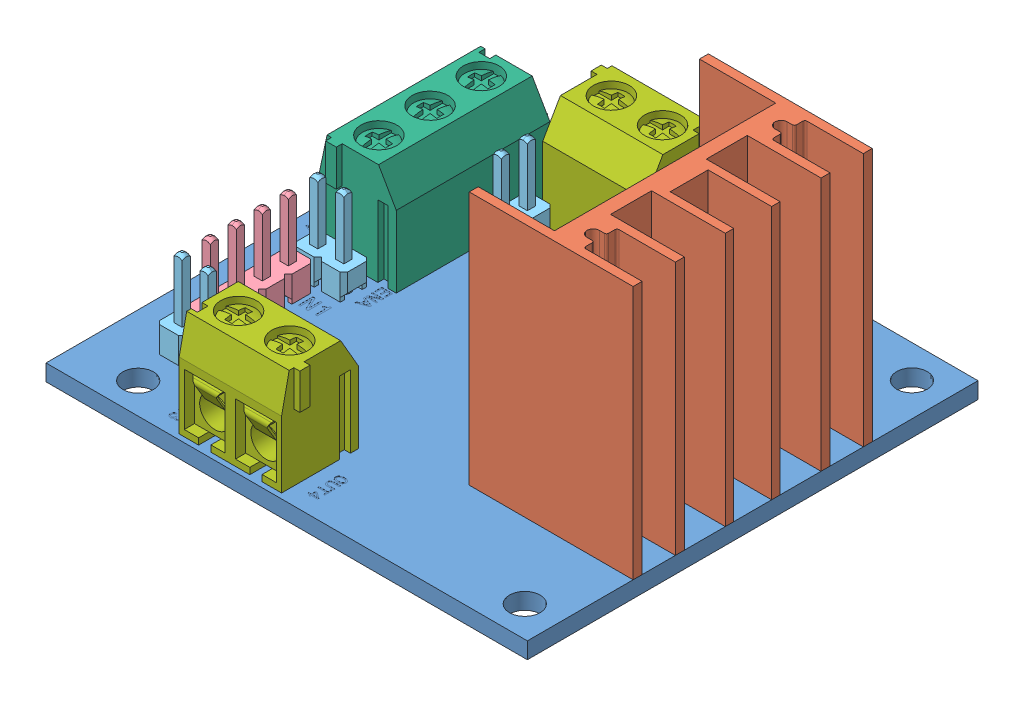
SolidWorks assembly Motor Drive Controller Module L298N.SLDASM, configuration Default (file format 11000). Lengths in mm.
Overall size (47 28.4 44).
12 component instances, 8 part files, 0 mates.
Components (placement in the parent):
- PCB_motor drive-1: PCB_motor drive.sldprt [Default] x (1 0 0) z (0 1 0) size (47 44 1.6)
- DISSIPATORE EXT_L298N-1: DISSIPATORE EXT_L298N.sldprt [Default] at (15.5 14 0) x (-1 0 0) z (0 1 0) size (16 23.35 24.8)
- L298N-1: L298N.sldprt [Default] at (13.23 10.95 0) x (-1 0 0) z (0 1 0) size (9.91 20.2 25.1)
- pin 8-2.54-1: pin 8-2.54.sldprt [Default] at (-17.73 4.14 11.73) x (0 0 -1) z (0 1 0) size (10.16 2.54 11.54)
- pin 8-2.54_2-1: pin 8-2.54_2.sldprt [Default] at (-17.73 4.14 14.48) x (1 0 0) z (0 1 0) size (5.08 2.54 11.54)
- pin 8-2.54_2-2: pin 8-2.54_2.sldprt [Default] at (-17.73 4.14 1.23) x (1 0 0) z (0 1 0) size (5.08 2.54 11.54)
- pin 8-2.54_2-3: pin 8-2.54_2.sldprt [Default] at (-10.73 4.14 -9.69) x (0 0 -1) z (0 1 0) size (5.08 2.54 11.54)
- TE_1776244-2-1: TE_1776244-2.sldprt [Default] at (-16.5 1.6 -11) x (0 0 1) z (-1 0 0) size (16.16 13.5 7.5)
- TE_1776244-2_2-1: TE_1776244-2_2.sldprt [Default] at (-6 1.6 -18.2) x (-1 0 0) z (0 0 -1) size (11.16 13.5 7.5)
- TE_1776244-2_2-2: TE_1776244-2_2.sldprt [Default] at (-6 1.6 18.2) size (11.16 13.5 7.5)
- PIN BLOCCO DISSIPATORE EXT-1: PIN BLOCCO DISSIPATORE EXT.sldprt [Default] at (17.1 -1.9 9.175) x (1 0 0) z (0 1 0) size (1 1 10)
- PIN BLOCCO DISSIPATORE EXT-2: PIN BLOCCO DISSIPATORE EXT.sldprt [Default] at (17.1 -1.9 -9.175) x (1 0 0) z (0 1 0) size (1 1 10)
